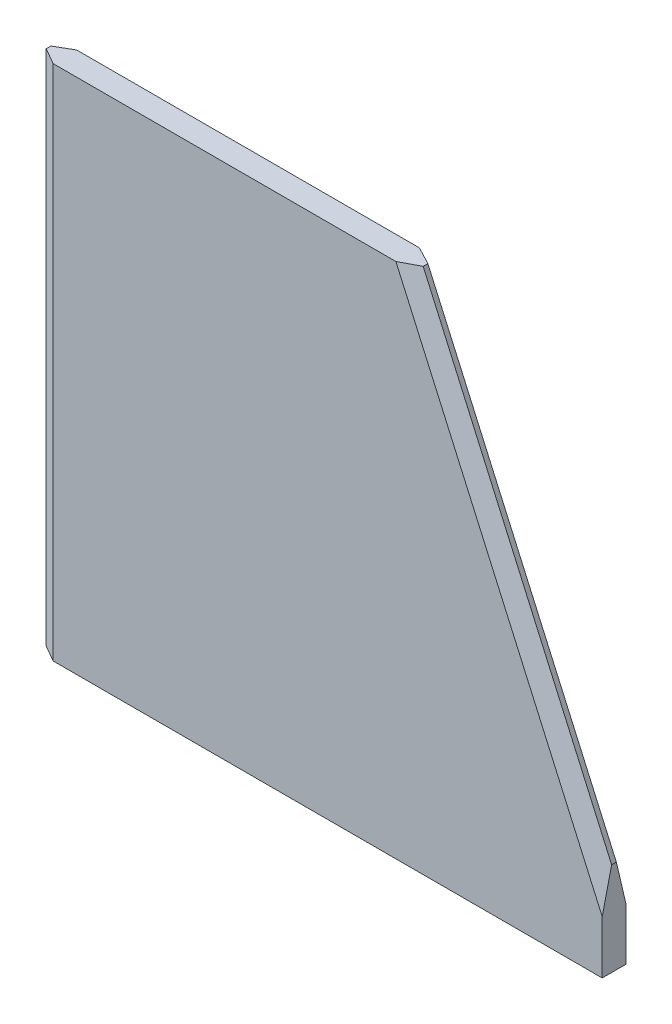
from build123d import *

# Parameters (mm, degrees)
BOSS_EXTRUDE1_DEPTH = 3.175
CHAMFER1_SIZE       = 1.27
CHAMFER1_SIZE2      = 2.199704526
CHAMFER2_SIZE       = 1.27
CHAMFER2_SIZE2      = 2.199704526


with BuildPart() as part:
    # Sketch1 → Boss-Extrude1 (new body)
    with BuildSketch(Plane.XY):
        Polygon((0, 0), (76.2, 0), (76.2, 12.573), (50.8, 69.723), (0, 69.723), (0, 12.573), align=None)
    extrude(amount=BOSS_EXTRUDE1_DEPTH)

    # Chamfer1
    chamfer1_edges = [part.edges().sort_by_distance(p)[0] for p in [
        (63.5, 41.148, 3.175),
        (63.5, 41.148, 0),
    ]]
    chamfer1_side = [part.faces().sort_by_distance(p)[0] for p in [
        (63.5, 41.148, 1.5875),
    ]]
    chamfer(chamfer1_edges, length=CHAMFER1_SIZE, length2=CHAMFER1_SIZE2, reference=chamfer1_side[0])

    # Chamfer2
    chamfer2_edges = [part.edges().sort_by_distance(p)[0] for p in [
        (0, 34.8615, 3.175),
        (0, 34.8615, 0),
    ]]
    chamfer2_side = [part.faces().sort_by_distance(p)[0] for p in [
        (0, 34.8615, 1.5875),
    ]]
    chamfer(chamfer2_edges, length=CHAMFER2_SIZE, length2=CHAMFER2_SIZE2, reference=chamfer2_side[0])


solid = part.part
